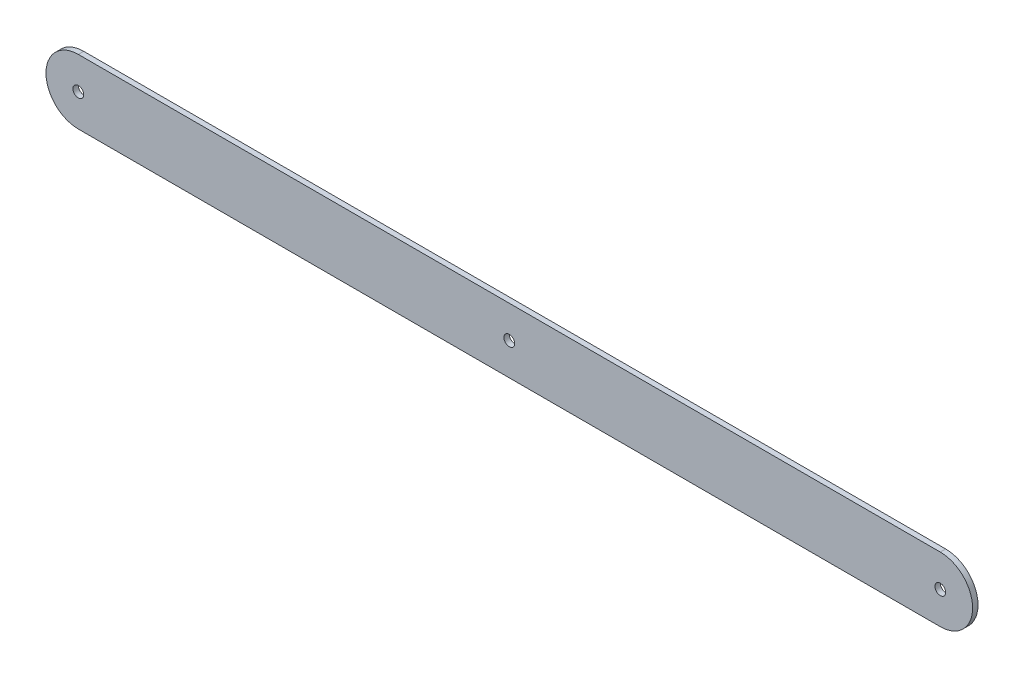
from build123d import *

# Parameters (mm, degrees)
SKETCH3_R           = 1
BOSS_EXTRUDE1_DEPTH = 1
SKETCH4_R           = 1
CUT_EXTRUDE1_DEPTH  = 167.111408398


with BuildPart() as part:
    # Sketch3 → Boss-Extrude1 (new body)
    with BuildSketch(Plane.XY):
        with BuildLine():
            Line((0, 6), (160, 6))
            ThreePointArc((160, 6), (166, 0), (160, -6))
            Line((160, -6), (0, -6))
            ThreePointArc((0, -6), (-6, 0), (0, 6))
        make_face()
        with Locations((80, 0)):
            Circle(SKETCH3_R, mode=Mode.SUBTRACT)
    extrude(amount=BOSS_EXTRUDE1_DEPTH)

    # Sketch4 → Cut-Extrude1 (cut, through all)
    with BuildSketch(Plane.XY):
        Circle(SKETCH4_R)
        with Locations((160, 0)):
            Circle(SKETCH4_R)
    extrude(amount=CUT_EXTRUDE1_DEPTH, mode=Mode.SUBTRACT)


solid = part.part
